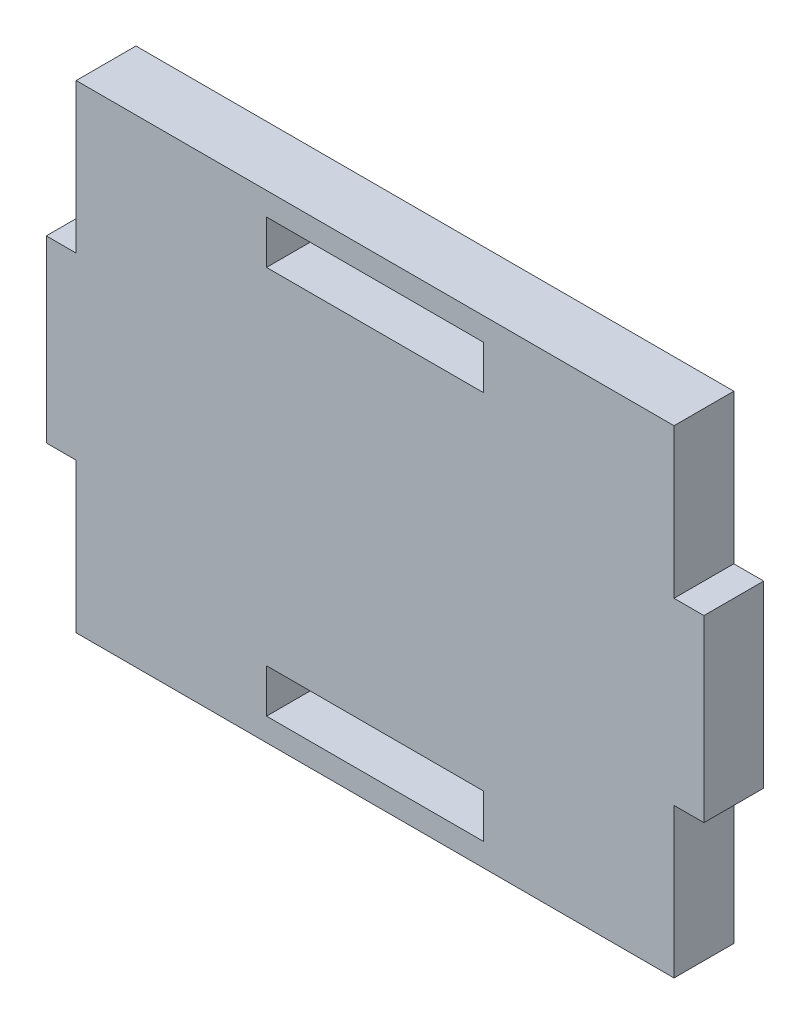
from build123d import *

# Parameters (mm, degrees)
SKETCH1_W           = 36.3186722
SKETCH1_H           = 7.302904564
BOSS_EXTRUDE1_DEPTH = 10


with BuildPart() as part:
    # Sketch1 → Boss-Extrude1 (new body)
    with BuildSketch(Plane.XY):
        Polygon((-50, -40), (50, -40), (50, -15), (55, -15), (55, 15), (50, 15), (50, 40), (-50, 40), (-50, 15), (-55, 15), (-55, -15), (-50, -15), align=None)
        with Locations((0, 32.5)):
            Rectangle(SKETCH1_W, SKETCH1_H, mode=Mode.SUBTRACT)
        with Locations((0, -32.5)):
            Rectangle(SKETCH1_W, SKETCH1_H, mode=Mode.SUBTRACT)
    extrude(amount=BOSS_EXTRUDE1_DEPTH)


solid = part.part
